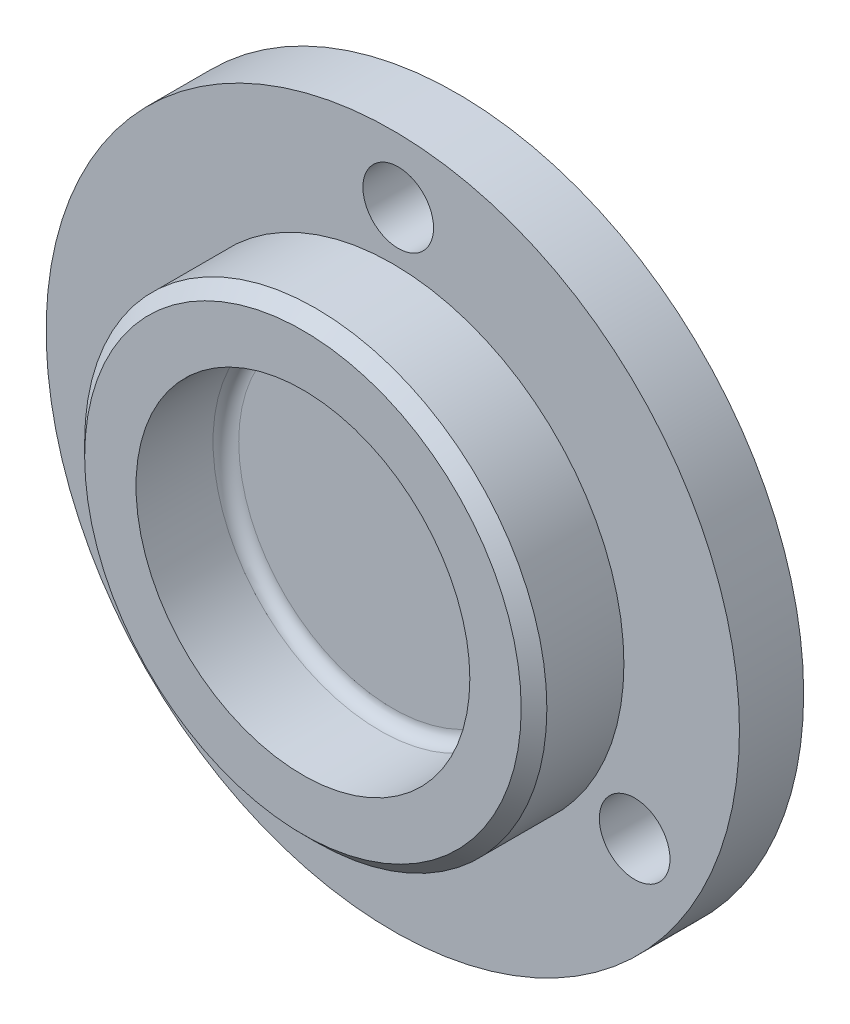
from build123d import *

# Parameters (mm, degrees)
ESQUISSE1_R                  = 27
EXTRUSION1_DEPTH             = 5
ESQUISSE2_R                  = 18
EXTRUSION2_DEPTH             = 7
ESQUISSE3_R                  = 13
ENL_V_MAT_EXTRU_2_DEPTH      = 7
CONG_1_R                     = 1
D_GAGEMENT_M51_D             = 5.5
R_P_TITION_CIRCULAIRE1_COUNT = 3
CHANFREIN1_SIZE              = 1


with BuildPart() as part:
    # Esquisse1 → Extrusion1 (new body)
    with BuildSketch(Plane.XY):
        Circle(ESQUISSE1_R)
    extrude(amount=EXTRUSION1_DEPTH)

    # Esquisse2 → Extrusion2 (add)
    with BuildSketch(Plane.XY.offset(5)):
        Circle(ESQUISSE2_R)
    extrude(amount=EXTRUSION2_DEPTH)

    # Esquisse3 → Enl_v. mat.-Extru.2 (cut)
    with BuildSketch(Plane.XY.offset(12)):
        Circle(ESQUISSE3_R)
    extrude(amount=-ENL_V_MAT_EXTRU_2_DEPTH, mode=Mode.SUBTRACT)

    # Cong_1
    cong_1_edges = [part.edges().sort_by_distance(p)[0] for p in [
        (-13, 0, 5),
    ]]
    fillet(cong_1_edges, radius=CONG_1_R)

    # D_gagement M51 (through all)
    with Locations(Plane(origin=(0.422998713, 21.995933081, 0), x_dir=(-1, 0, 0), z_dir=(0, 0, -1))):
        with Locations((0, 0)):
            d_gagement_m51 = Hole(D_GAGEMENT_M51_D / 2)

    # R_p_tition circulaire1: D_gagement M51 ×3 about axis
    r_p_tition_circulaire1_axis = Axis((0, 0, 0), (0, 0, 1))
    for i in range(1, R_P_TITION_CIRCULAIRE1_COUNT):
        add(d_gagement_m51.rotate(r_p_tition_circulaire1_axis, i * 360 / R_P_TITION_CIRCULAIRE1_COUNT), mode=Mode.SUBTRACT)

    # Chanfrein1
    chanfrein1_edges = [part.edges().sort_by_distance(p)[0] for p in [
        (-18, 0, 12),
    ]]
    chamfer(chanfrein1_edges, length=CHANFREIN1_SIZE)


solid = part.part
